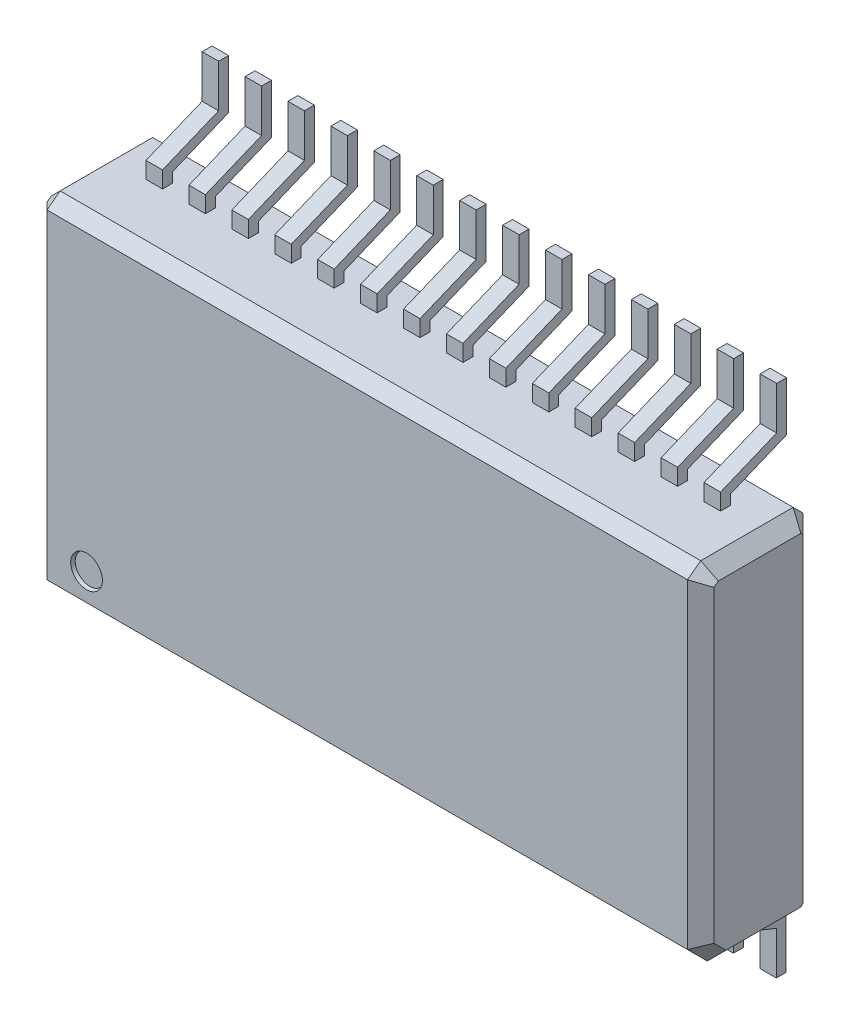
from build123d import *

# Parameters (mm, degrees)
BASE_EXTRUDE_DEPTH = 2
SKETCH2_OUTSIDE_W  = 6.584
SKETCH2_OUTSIDE_H  = 12.384
CUT_EXTRUDE1_DEPTH = 21.3
CHAMFER1_SIZE      = 0.2
SKETCH3_R          = 0.24
CUT_EXTRUDE2_DEPTH = 0.05
CUT_EXTRUDE2_DRAFT = -20


with BuildPart() as part:
    # Sketch1 → Base-Extrude (new body)
    with BuildSketch(Plane.XY):
        Polygon((1.35, 7.8), (1.35, 6.55), (0.95, 6.55), (0.95, 7.8), (0.7, 7.8), (0.7, 6.55), (0, 6.55), (0, 1.25), (0.695, 1.25), (0.695, 0), (0.945, 0), (0.945, 1.25), (1.345, 1.25), (1.345, 0), (1.595, 0), (1.595, 1.25), (1.995, 1.25), (1.995, 0), (2.245, 0), (2.245, 1.25), (2.645, 1.25), (2.645, 0), (2.895, 0), (2.895, 1.25), (3.295, 1.25), (3.295, 0), (3.545, 0), (3.545, 1.25), (3.945, 1.25), (3.945, 0), (4.195, 0), (4.195, 1.25), (4.595, 1.25), (4.595, 0), (4.845, 0), (4.845, 1.25), (5.245, 1.25), (5.245, 0), (5.495, 0), (5.495, 1.25), (5.895, 1.25), (5.895, 0), (6.145, 0), (6.145, 1.25), (6.545, 1.25), (6.545, 0), (6.795, 0), (6.795, 1.25), (7.195, 1.25), (7.195, 0), (7.445, 0), (7.445, 1.25), (7.845, 1.25), (7.845, 0), (8.095, 0), (8.095, 1.25), (8.495, 1.25), (8.495, 0), (8.745, 0), (8.745, 1.25), (9.145, 1.25), (9.145, 0), (9.395, 0), (9.395, 1.25), (10.1, 1.25), (10.1, 6.55), (9.4, 6.55), (9.4, 7.8), (9.15, 7.8), (9.15, 6.55), (8.75, 6.55), (8.75, 7.8), (8.5, 7.8), (8.5, 6.55), (8.1, 6.55), (8.1, 7.8), (7.85, 7.8), (7.85, 6.55), (7.45, 6.55), (7.45, 7.8), (7.2, 7.8), (7.2, 6.55), (6.8, 6.55), (6.8, 7.8), (6.55, 7.8), (6.55, 6.55), (6.15, 6.55), (6.15, 7.8), (5.9, 7.8), (5.9, 6.55), (5.5, 6.55), (5.5, 7.8), (5.25, 7.8), (5.25, 6.55), (4.85, 6.55), (4.85, 7.8), (4.6, 7.8), (4.6, 6.55), (4.2, 6.55), (4.2, 7.8), (3.95, 7.8), (3.95, 6.55), (3.55, 6.55), (3.55, 7.8), (3.3, 7.8), (3.3, 6.55), (2.9, 6.55), (2.9, 7.8), (2.65, 7.8), (2.65, 6.55), (2.25, 6.55), (2.25, 7.8), (2, 7.8), (2, 6.55), (1.6, 6.55), (1.6, 7.8), align=None)
    extrude(amount=BASE_EXTRUDE_DEPTH)

    # Sketch2 outside → Cut-Extrude1 (cut)
    with BuildSketch(Plane(origin=(0, 0, 0), x_dir=(0, 0, -1), z_dir=(1, 0, 0))):
        with Locations((-1, 3.9)):
            Rectangle(SKETCH2_OUTSIDE_W, SKETCH2_OUTSIDE_H)
        Polygon((-0.25, 6.4), (-0.25, 1.4), (-0.4, 1.25), (-0.85, 1.25), (-0.85, 1.1), (0, 0.75), (0, 0), (-0.15, 0), (-0.15, 0.65), (-1, 1), (-1, 1.25), (-1.7, 1.25), (-2, 1.55), (-2, 6.4), (-1.8, 6.55), (-1, 6.55), (-1, 6.8), (-0.15, 7.15), (-0.15, 7.8), (0, 7.8), (0, 7.05), (-0.85, 6.7), (-0.85, 6.55), (-0.4, 6.55), align=None, mode=Mode.SUBTRACT)
    extrude(amount=CUT_EXTRUDE1_DEPTH, mode=Mode.SUBTRACT)

    # Chamfer1
    chamfer1_edges = [part.edges().sort_by_distance(p)[0] for p in [
        (10.1, 6.55, 1.1),
        (0, 6.55, 1.1),
        (0, 6.475, 0.325),
        (0, 6.475, 1.9),
        (0, 3.975, 2),
        (0, 1.4, 1.85),
        (0, 1.25, 1.05),
        (0, 1.325, 0.325),
        (0, 3.9, 0.25),
        (10.1, 3.9, 0.25),
        (10.1, 1.325, 0.325),
        (10.1, 1.25, 1.05),
        (10.1, 1.4, 1.85),
        (10.1, 3.975, 2),
        (10.1, 6.475, 1.9),
        (10.1, 6.475, 0.325),
    ]]
    chamfer(chamfer1_edges, length=CHAMFER1_SIZE)


with BuildPart() as cut_extrude2_tool:
    # Sketch3 → Cut-Extrude2 (with draft: the straight prism first)
    with BuildSketch(Plane.XY.offset(2)):
        with Locations((0.8, 1.96)):
            Circle(SKETCH3_R)
    extrude(amount=-CUT_EXTRUDE2_DEPTH)
    # Cut-Extrude2: the draft: its side faces are tilted about the plane it starts from
    cut_extrude2_sides = [cut_extrude2_tool.faces().sort_by_distance(p)[0] for p in [
        (0.56, 1.96, 1.975),
    ]]
    draft(cut_extrude2_sides, Plane.XY.offset(2), CUT_EXTRUDE2_DRAFT)


with BuildPart() as part_1:
    add(part.part)

    # Cut-Extrude2: cut by cut_extrude2_tool
    add(cut_extrude2_tool.part, mode=Mode.SUBTRACT)


solid = part_1.part
